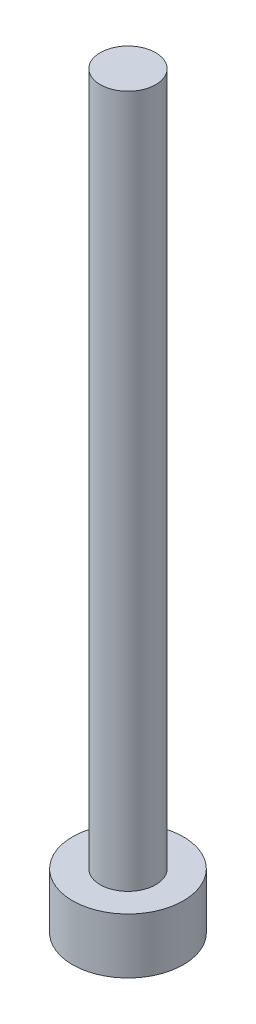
from build123d import *


with BuildPart() as part:
    # Esquisse1 → Base-R_volution (revolve)
    with BuildSketch(Plane.XY, mode=Mode.PRIVATE) as base_r_volution_sk:
        Polygon((0, 0), (-4, 0), (-4, 4), (-2, 4), (-2, 54), (0, 54), align=None)
    revolve(base_r_volution_sk.sketch.rotate(Axis((0, 49.432307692, 0), (0, -1, 0)), 270), axis=Axis((0, 49.432307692, 0), (0, -1, 0)))


solid = part.part
